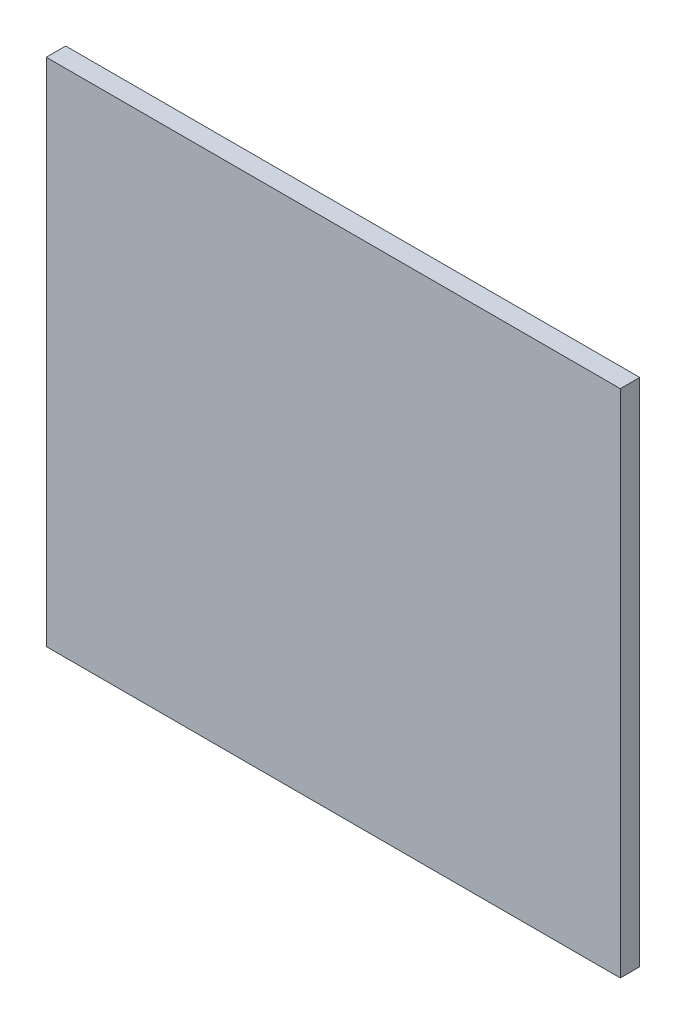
ISO-10303-21;
HEADER;
FILE_DESCRIPTION(('STEP AP214'),'2;1');
FILE_NAME('part.step','',(''),(''),'','','');
FILE_SCHEMA(('AUTOMOTIVE_DESIGN { 1 0 10303 214 1 1 1 1 }'));
ENDSEC;
DATA;
#1=APPLICATION_CONTEXT('core data for automotive mechanical design processes');
#2=APPLICATION_PROTOCOL_DEFINITION('international standard','automotive_design',2000,#1);
#3=PRODUCT_CONTEXT('',#1,'mechanical');
#4=PRODUCT('Part','Part','',(#3));
#5=PRODUCT_RELATED_PRODUCT_CATEGORY('part','',(#4));
#6=PRODUCT_DEFINITION_FORMATION('','',#4);
#7=PRODUCT_DEFINITION_CONTEXT('part definition',#1,'design');
#8=PRODUCT_DEFINITION('design','',#6,#7);
#9=PRODUCT_DEFINITION_SHAPE('','',#8);
#10=(LENGTH_UNIT() NAMED_UNIT(*) SI_UNIT(.MILLI.,.METRE.));
#11=(NAMED_UNIT(*) PLANE_ANGLE_UNIT() SI_UNIT($,.RADIAN.));
#12=(NAMED_UNIT(*) SI_UNIT($,.STERADIAN.) SOLID_ANGLE_UNIT());
#13=UNCERTAINTY_MEASURE_WITH_UNIT(LENGTH_MEASURE(1.E-05),#10,'distance_accuracy_value','');
#14=(GEOMETRIC_REPRESENTATION_CONTEXT(3) GLOBAL_UNCERTAINTY_ASSIGNED_CONTEXT((#13)) GLOBAL_UNIT_ASSIGNED_CONTEXT((#10,
#11,#12)) REPRESENTATION_CONTEXT('',''));
#15=CARTESIAN_POINT('',(0.,0.,0.));
#16=DIRECTION('',(0.,0.,1.));
#17=DIRECTION('',(1.,0.,0.));
#18=AXIS2_PLACEMENT_3D('',#15,#16,#17);
#19=CARTESIAN_POINT('',(4.72504974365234,7.02505004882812,-0.03048));
#20=DIRECTION('',(0.,-1.,0.));
#21=DIRECTION('',(0.,0.,-1.));
#22=AXIS2_PLACEMENT_3D('',#19,#20,#21);
#23=PLANE('',#22);
#24=DIRECTION('',(1.,0.,0.));
#25=VECTOR('',#24,1.);
#26=CARTESIAN_POINT('',(5.17499984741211,7.02505004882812,0.));
#27=LINE('',#26,#25);
#28=CARTESIAN_POINT('',(4.72504974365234,7.02505004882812,0.));
#29=VERTEX_POINT('',#28);
#30=CARTESIAN_POINT('',(5.62494995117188,7.02505004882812,0.));
#31=VERTEX_POINT('',#30);
#32=EDGE_CURVE('E67',#29,#31,#27,.T.);
#33=ORIENTED_EDGE('',*,*,#32,.T.);
#34=DIRECTION('',(0.,0.,-1.));
#35=VECTOR('',#34,1.);
#36=CARTESIAN_POINT('',(5.62494995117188,7.02505004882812,-0.01524));
#37=LINE('',#36,#35);
#38=CARTESIAN_POINT('',(5.62494995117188,7.02505004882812,-0.03048));
#39=VERTEX_POINT('',#38);
#40=EDGE_CURVE('E88',#31,#39,#37,.T.);
#41=ORIENTED_EDGE('',*,*,#40,.T.);
#42=DIRECTION('',(1.,0.,0.));
#43=VECTOR('',#42,1.);
#44=CARTESIAN_POINT('',(4.72504974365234,7.02505004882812,-0.03048));
#45=LINE('',#44,#43);
#46=CARTESIAN_POINT('',(4.72504974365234,7.02505004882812,-0.03048));
#47=VERTEX_POINT('',#46);
#48=EDGE_CURVE('E69',#47,#39,#45,.T.);
#49=ORIENTED_EDGE('',*,*,#48,.F.);
#50=DIRECTION('',(0.,0.,-1.));
#51=VECTOR('',#50,1.);
#52=CARTESIAN_POINT('',(4.72504974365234,7.02505004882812,-0.01524));
#53=LINE('',#52,#51);
#54=EDGE_CURVE('E11',#29,#47,#53,.T.);
#55=ORIENTED_EDGE('',*,*,#54,.F.);
#56=EDGE_LOOP('',(#33,#41,#49,#55));
#57=FACE_BOUND('',#56,.T.);
#58=ADVANCED_FACE('F17',(#57),#23,.F.);
#59=CARTESIAN_POINT('',(4.72504974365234,6.22494995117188,-0.03048));
#60=DIRECTION('',(1.,0.,0.));
#61=DIRECTION('',(0.,1.,0.));
#62=AXIS2_PLACEMENT_3D('',#59,#60,#61);
#63=PLANE('',#62);
#64=DIRECTION('',(0.,1.,0.));
#65=VECTOR('',#64,1.);
#66=CARTESIAN_POINT('',(4.72504974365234,6.625,0.));
#67=LINE('',#66,#65);
#68=CARTESIAN_POINT('',(4.72504974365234,6.22494995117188,0.));
#69=VERTEX_POINT('',#68);
#70=EDGE_CURVE('E73',#69,#29,#67,.T.);
#71=ORIENTED_EDGE('',*,*,#70,.T.);
#72=ORIENTED_EDGE('',*,*,#54,.T.);
#73=DIRECTION('',(0.,1.,0.));
#74=VECTOR('',#73,1.);
#75=CARTESIAN_POINT('',(4.72504974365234,6.22494995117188,-0.03048));
#76=LINE('',#75,#74);
#77=CARTESIAN_POINT('',(4.72504974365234,6.22494995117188,-0.03048));
#78=VERTEX_POINT('',#77);
#79=EDGE_CURVE('E106',#78,#47,#76,.T.);
#80=ORIENTED_EDGE('',*,*,#79,.F.);
#81=DIRECTION('',(0.,0.,-1.));
#82=VECTOR('',#81,1.);
#83=CARTESIAN_POINT('',(4.72504974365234,6.22494995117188,-0.01524));
#84=LINE('',#83,#82);
#85=EDGE_CURVE('E26',#69,#78,#84,.T.);
#86=ORIENTED_EDGE('',*,*,#85,.F.);
#87=EDGE_LOOP('',(#71,#72,#80,#86));
#88=FACE_BOUND('',#87,.T.);
#89=ADVANCED_FACE('F74',(#88),#63,.F.);
#90=CARTESIAN_POINT('',(5.62494995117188,6.22494995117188,-0.03048));
#91=DIRECTION('',(0.,1.,0.));
#92=DIRECTION('',(1.,0.,0.));
#93=AXIS2_PLACEMENT_3D('',#90,#91,#92);
#94=PLANE('',#93);
#95=DIRECTION('',(-1.,0.,0.));
#96=VECTOR('',#95,1.);
#97=CARTESIAN_POINT('',(5.17499984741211,6.22494995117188,0.));
#98=LINE('',#97,#96);
#99=CARTESIAN_POINT('',(5.62494995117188,6.22494995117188,0.));
#100=VERTEX_POINT('',#99);
#101=EDGE_CURVE('E78',#100,#69,#98,.T.);
#102=ORIENTED_EDGE('',*,*,#101,.T.);
#103=ORIENTED_EDGE('',*,*,#85,.T.);
#104=DIRECTION('',(-1.,0.,0.));
#105=VECTOR('',#104,1.);
#106=CARTESIAN_POINT('',(5.62494995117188,6.22494995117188,-0.03048));
#107=LINE('',#106,#105);
#108=CARTESIAN_POINT('',(5.62494995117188,6.22494995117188,-0.03048));
#109=VERTEX_POINT('',#108);
#110=EDGE_CURVE('E96',#109,#78,#107,.T.);
#111=ORIENTED_EDGE('',*,*,#110,.F.);
#112=DIRECTION('',(0.,0.,-1.));
#113=VECTOR('',#112,1.);
#114=CARTESIAN_POINT('',(5.62494995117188,6.22494995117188,-0.01524));
#115=LINE('',#114,#113);
#116=EDGE_CURVE('E91',#100,#109,#115,.T.);
#117=ORIENTED_EDGE('',*,*,#116,.F.);
#118=EDGE_LOOP('',(#102,#103,#111,#117));
#119=FACE_BOUND('',#118,.T.);
#120=ADVANCED_FACE('F139',(#119),#94,.F.);
#121=CARTESIAN_POINT('',(5.62494995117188,7.02505004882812,-0.03048));
#122=DIRECTION('',(-1.,0.,0.));
#123=DIRECTION('',(0.,0.,1.));
#124=AXIS2_PLACEMENT_3D('',#121,#122,#123);
#125=PLANE('',#124);
#126=DIRECTION('',(0.,-1.,0.));
#127=VECTOR('',#126,1.);
#128=CARTESIAN_POINT('',(5.62494995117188,6.625,0.));
#129=LINE('',#128,#127);
#130=EDGE_CURVE('E83',#31,#100,#129,.T.);
#131=ORIENTED_EDGE('',*,*,#130,.T.);
#132=ORIENTED_EDGE('',*,*,#116,.T.);
#133=DIRECTION('',(0.,-1.,0.));
#134=VECTOR('',#133,1.);
#135=CARTESIAN_POINT('',(5.62494995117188,7.02505004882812,-0.03048));
#136=LINE('',#135,#134);
#137=EDGE_CURVE('E92',#39,#109,#136,.T.);
#138=ORIENTED_EDGE('',*,*,#137,.F.);
#139=ORIENTED_EDGE('',*,*,#40,.F.);
#140=EDGE_LOOP('',(#131,#132,#138,#139));
#141=FACE_BOUND('',#140,.T.);
#142=ADVANCED_FACE('F130',(#141),#125,.F.);
#143=CARTESIAN_POINT('',(5.17499984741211,6.625,-0.03048));
#144=DIRECTION('',(0.,0.,1.));
#145=DIRECTION('',(1.,0.,0.));
#146=AXIS2_PLACEMENT_3D('',#143,#144,#145);
#147=PLANE('',#146);
#148=ORIENTED_EDGE('',*,*,#48,.T.);
#149=ORIENTED_EDGE('',*,*,#137,.T.);
#150=ORIENTED_EDGE('',*,*,#110,.T.);
#151=ORIENTED_EDGE('',*,*,#79,.T.);
#152=EDGE_LOOP('',(#148,#149,#150,#151));
#153=FACE_BOUND('',#152,.T.);
#154=ADVANCED_FACE('F121',(#153),#147,.F.);
#155=CARTESIAN_POINT('',(5.17499984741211,6.625,0.));
#156=DIRECTION('',(0.,0.,1.));
#157=DIRECTION('',(1.,0.,0.));
#158=AXIS2_PLACEMENT_3D('',#155,#156,#157);
#159=PLANE('',#158);
#160=ORIENTED_EDGE('',*,*,#32,.F.);
#161=ORIENTED_EDGE('',*,*,#70,.F.);
#162=ORIENTED_EDGE('',*,*,#101,.F.);
#163=ORIENTED_EDGE('',*,*,#130,.F.);
#164=EDGE_LOOP('',(#160,#161,#162,#163));
#165=FACE_BOUND('',#164,.T.);
#166=ADVANCED_FACE('F81',(#165),#159,.T.);
#167=CLOSED_SHELL('',(#58,#89,#120,#142,#154,#166));
#168=MANIFOLD_SOLID_BREP('B1',#167);
#169=ADVANCED_BREP_SHAPE_REPRESENTATION('',(#18,#168),#14);
#170=SHAPE_DEFINITION_REPRESENTATION(#9,#169);
ENDSEC;
END-ISO-10303-21;
